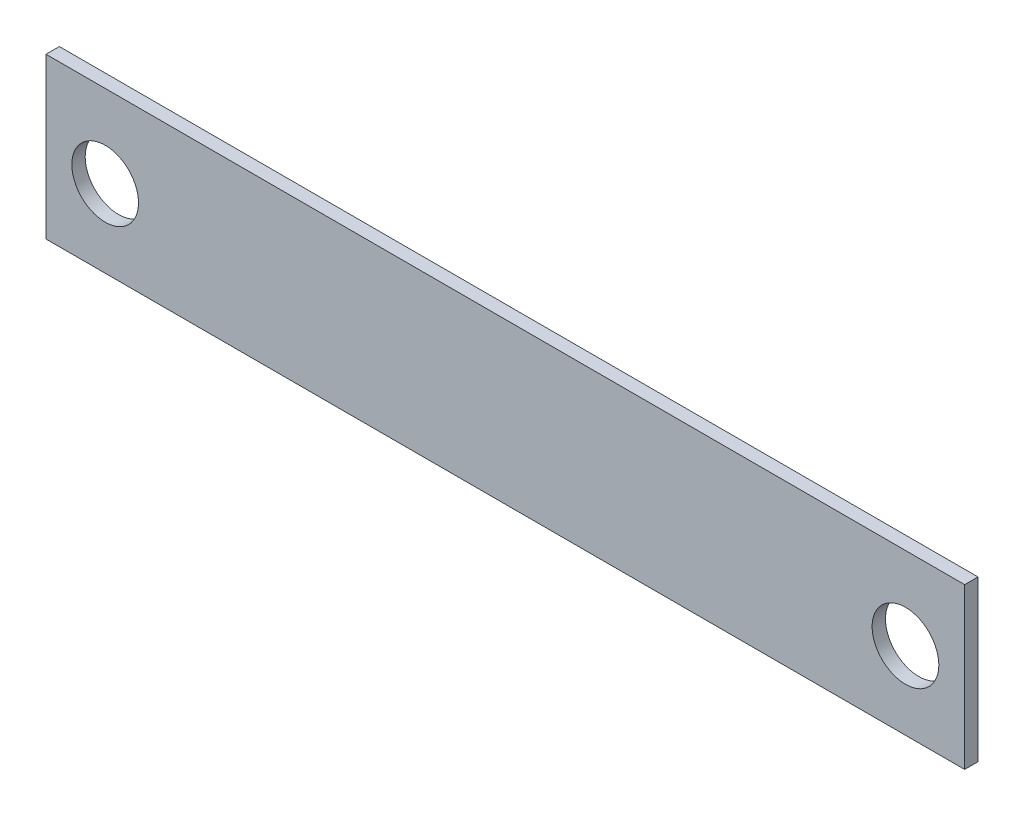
ISO-10303-21;
HEADER;
FILE_DESCRIPTION(('STEP AP214'),'2;1');
FILE_NAME('part.step','',(''),(''),'','','');
FILE_SCHEMA(('AUTOMOTIVE_DESIGN { 1 0 10303 214 1 1 1 1 }'));
ENDSEC;
DATA;
#1=APPLICATION_CONTEXT('core data for automotive mechanical design processes');
#2=APPLICATION_PROTOCOL_DEFINITION('international standard','automotive_design',2000,#1);
#3=PRODUCT_CONTEXT('',#1,'mechanical');
#4=PRODUCT('Part','Part','',(#3));
#5=PRODUCT_RELATED_PRODUCT_CATEGORY('part','',(#4));
#6=PRODUCT_DEFINITION_FORMATION('','',#4);
#7=PRODUCT_DEFINITION_CONTEXT('part definition',#1,'design');
#8=PRODUCT_DEFINITION('design','',#6,#7);
#9=PRODUCT_DEFINITION_SHAPE('','',#8);
#10=(LENGTH_UNIT() NAMED_UNIT(*) SI_UNIT(.MILLI.,.METRE.));
#11=(NAMED_UNIT(*) PLANE_ANGLE_UNIT() SI_UNIT($,.RADIAN.));
#12=(NAMED_UNIT(*) SI_UNIT($,.STERADIAN.) SOLID_ANGLE_UNIT());
#13=UNCERTAINTY_MEASURE_WITH_UNIT(LENGTH_MEASURE(1.E-05),#10,'distance_accuracy_value','');
#14=(GEOMETRIC_REPRESENTATION_CONTEXT(3) GLOBAL_UNCERTAINTY_ASSIGNED_CONTEXT((#13)) GLOBAL_UNIT_ASSIGNED_CONTEXT((#10,
#11,#12)) REPRESENTATION_CONTEXT('',''));
#15=CARTESIAN_POINT('',(0.,0.,0.));
#16=DIRECTION('',(0.,0.,1.));
#17=DIRECTION('',(1.,0.,0.));
#18=AXIS2_PLACEMENT_3D('',#15,#16,#17);
#19=CARTESIAN_POINT('',(0.,0.,50.8));
#20=DIRECTION('',(1.,0.,0.));
#21=DIRECTION('',(0.,0.,-1.));
#22=AXIS2_PLACEMENT_3D('',#19,#20,#21);
#23=PLANE('',#22);
#24=DIRECTION('',(0.,-1.,0.));
#25=VECTOR('',#24,1.);
#26=CARTESIAN_POINT('',(0.,0.,0.));
#27=LINE('',#26,#25);
#28=CARTESIAN_POINT('',(0.,609.6,0.));
#29=VERTEX_POINT('',#28);
#30=CARTESIAN_POINT('',(0.,0.,0.));
#31=VERTEX_POINT('',#30);
#32=EDGE_CURVE('E106',#29,#31,#27,.T.);
#33=ORIENTED_EDGE('',*,*,#32,.T.);
#34=DIRECTION('',(0.,0.,-1.));
#35=VECTOR('',#34,1.);
#36=CARTESIAN_POINT('',(0.,0.,50.8));
#37=LINE('',#36,#35);
#38=CARTESIAN_POINT('',(0.,0.,50.8));
#39=VERTEX_POINT('',#38);
#40=EDGE_CURVE('E11',#39,#31,#37,.T.);
#41=ORIENTED_EDGE('',*,*,#40,.F.);
#42=DIRECTION('',(0.,-1.,0.));
#43=VECTOR('',#42,1.);
#44=CARTESIAN_POINT('',(0.,0.,50.8));
#45=LINE('',#44,#43);
#46=CARTESIAN_POINT('',(0.,609.6,50.8));
#47=VERTEX_POINT('',#46);
#48=EDGE_CURVE('E90',#47,#39,#45,.T.);
#49=ORIENTED_EDGE('',*,*,#48,.F.);
#50=DIRECTION('',(0.,0.,-1.));
#51=VECTOR('',#50,1.);
#52=CARTESIAN_POINT('',(0.,609.6,50.8));
#53=LINE('',#52,#51);
#54=EDGE_CURVE('E102',#47,#29,#53,.T.);
#55=ORIENTED_EDGE('',*,*,#54,.T.);
#56=EDGE_LOOP('',(#33,#41,#49,#55));
#57=FACE_BOUND('',#56,.T.);
#58=ADVANCED_FACE('F38',(#57),#23,.F.);
#59=CARTESIAN_POINT('',(0.,0.,50.8));
#60=DIRECTION('',(0.,1.,0.));
#61=DIRECTION('',(0.,0.,1.));
#62=AXIS2_PLACEMENT_3D('',#59,#60,#61);
#63=PLANE('',#62);
#64=DIRECTION('',(1.,0.,0.));
#65=VECTOR('',#64,1.);
#66=CARTESIAN_POINT('',(0.,0.,0.));
#67=LINE('',#66,#65);
#68=CARTESIAN_POINT('',(3498.85,0.,0.));
#69=VERTEX_POINT('',#68);
#70=EDGE_CURVE('E95',#31,#69,#67,.T.);
#71=ORIENTED_EDGE('',*,*,#70,.T.);
#72=DIRECTION('',(0.,0.,-1.));
#73=VECTOR('',#72,1.);
#74=CARTESIAN_POINT('',(3498.85,0.,50.8));
#75=LINE('',#74,#73);
#76=CARTESIAN_POINT('',(3498.85,0.,50.8));
#77=VERTEX_POINT('',#76);
#78=EDGE_CURVE('E47',#77,#69,#75,.T.);
#79=ORIENTED_EDGE('',*,*,#78,.F.);
#80=DIRECTION('',(1.,0.,0.));
#81=VECTOR('',#80,1.);
#82=CARTESIAN_POINT('',(0.,0.,50.8));
#83=LINE('',#82,#81);
#84=EDGE_CURVE('E85',#39,#77,#83,.T.);
#85=ORIENTED_EDGE('',*,*,#84,.F.);
#86=ORIENTED_EDGE('',*,*,#40,.T.);
#87=EDGE_LOOP('',(#71,#79,#85,#86));
#88=FACE_BOUND('',#87,.T.);
#89=ADVANCED_FACE('F94',(#88),#63,.F.);
#90=CARTESIAN_POINT('',(3498.85,0.,50.8));
#91=DIRECTION('',(-1.,0.,0.));
#92=DIRECTION('',(0.,0.,1.));
#93=AXIS2_PLACEMENT_3D('',#90,#91,#92);
#94=PLANE('',#93);
#95=DIRECTION('',(0.,1.,0.));
#96=VECTOR('',#95,1.);
#97=CARTESIAN_POINT('',(3498.85,0.,0.));
#98=LINE('',#97,#96);
#99=CARTESIAN_POINT('',(3498.85,609.6,0.));
#100=VERTEX_POINT('',#99);
#101=EDGE_CURVE('E72',#69,#100,#98,.T.);
#102=ORIENTED_EDGE('',*,*,#101,.T.);
#103=DIRECTION('',(0.,0.,-1.));
#104=VECTOR('',#103,1.);
#105=CARTESIAN_POINT('',(3498.85,609.6,50.8));
#106=LINE('',#105,#104);
#107=CARTESIAN_POINT('',(3498.85,609.6,50.8));
#108=VERTEX_POINT('',#107);
#109=EDGE_CURVE('E97',#108,#100,#106,.T.);
#110=ORIENTED_EDGE('',*,*,#109,.F.);
#111=DIRECTION('',(0.,1.,0.));
#112=VECTOR('',#111,1.);
#113=CARTESIAN_POINT('',(3498.85,0.,50.8));
#114=LINE('',#113,#112);
#115=EDGE_CURVE('E88',#77,#108,#114,.T.);
#116=ORIENTED_EDGE('',*,*,#115,.F.);
#117=ORIENTED_EDGE('',*,*,#78,.T.);
#118=EDGE_LOOP('',(#102,#110,#116,#117));
#119=FACE_BOUND('',#118,.T.);
#120=ADVANCED_FACE('F98',(#119),#94,.F.);
#121=CARTESIAN_POINT('',(0.,609.6,50.8));
#122=DIRECTION('',(0.,-1.,0.));
#123=DIRECTION('',(0.,0.,-1.));
#124=AXIS2_PLACEMENT_3D('',#121,#122,#123);
#125=PLANE('',#124);
#126=DIRECTION('',(-1.,0.,0.));
#127=VECTOR('',#126,1.);
#128=CARTESIAN_POINT('',(0.,609.6,0.));
#129=LINE('',#128,#127);
#130=EDGE_CURVE('E78',#100,#29,#129,.T.);
#131=ORIENTED_EDGE('',*,*,#130,.T.);
#132=ORIENTED_EDGE('',*,*,#54,.F.);
#133=DIRECTION('',(-1.,0.,0.));
#134=VECTOR('',#133,1.);
#135=CARTESIAN_POINT('',(0.,609.6,50.8));
#136=LINE('',#135,#134);
#137=EDGE_CURVE('E55',#108,#47,#136,.T.);
#138=ORIENTED_EDGE('',*,*,#137,.F.);
#139=ORIENTED_EDGE('',*,*,#109,.T.);
#140=EDGE_LOOP('',(#131,#132,#138,#139));
#141=FACE_BOUND('',#140,.T.);
#142=ADVANCED_FACE('F120',(#141),#125,.F.);
#143=CARTESIAN_POINT('',(0.,0.,50.8));
#144=DIRECTION('',(0.,0.,-1.));
#145=DIRECTION('',(-1.,0.,0.));
#146=AXIS2_PLACEMENT_3D('',#143,#144,#145);
#147=PLANE('',#146);
#148=CARTESIAN_POINT('',(3273.425,295.275,50.8));
#149=DIRECTION('',(0.,0.,1.));
#150=DIRECTION('',(1.,0.,0.));
#151=AXIS2_PLACEMENT_3D('',#148,#149,#150);
#152=CIRCLE('',#151,127.);
#153=CARTESIAN_POINT('',(3400.425,295.275,50.8));
#154=VERTEX_POINT('',#153);
#155=EDGE_CURVE('E135',#154,#154,#152,.T.);
#156=ORIENTED_EDGE('',*,*,#155,.F.);
#157=EDGE_LOOP('',(#156));
#158=FACE_BOUND('',#157,.T.);
#159=CARTESIAN_POINT('',(225.425,295.275,50.8));
#160=DIRECTION('',(0.,0.,-1.));
#161=DIRECTION('',(-1.,0.,0.));
#162=AXIS2_PLACEMENT_3D('',#159,#160,#161);
#163=CIRCLE('',#162,127.);
#164=CARTESIAN_POINT('',(98.425,295.275,50.8));
#165=VERTEX_POINT('',#164);
#166=EDGE_CURVE('E110',#165,#165,#163,.T.);
#167=ORIENTED_EDGE('',*,*,#166,.T.);
#168=EDGE_LOOP('',(#167));
#169=FACE_BOUND('',#168,.T.);
#170=ORIENTED_EDGE('',*,*,#48,.T.);
#171=ORIENTED_EDGE('',*,*,#84,.T.);
#172=ORIENTED_EDGE('',*,*,#115,.T.);
#173=ORIENTED_EDGE('',*,*,#137,.T.);
#174=EDGE_LOOP('',(#170,#171,#172,#173));
#175=FACE_BOUND('',#174,.T.);
#176=ADVANCED_FACE('F86',(#158,#169,#175),#147,.F.);
#177=CARTESIAN_POINT('',(0.,0.,0.));
#178=DIRECTION('',(0.,0.,-1.));
#179=DIRECTION('',(-1.,0.,0.));
#180=AXIS2_PLACEMENT_3D('',#177,#178,#179);
#181=PLANE('',#180);
#182=CARTESIAN_POINT('',(3273.425,295.275,0.));
#183=DIRECTION('',(0.,0.,1.));
#184=DIRECTION('',(1.,0.,0.));
#185=AXIS2_PLACEMENT_3D('',#182,#183,#184);
#186=CIRCLE('',#185,127.);
#187=CARTESIAN_POINT('',(3400.425,295.275,0.));
#188=VERTEX_POINT('',#187);
#189=EDGE_CURVE('E131',#188,#188,#186,.T.);
#190=ORIENTED_EDGE('',*,*,#189,.T.);
#191=EDGE_LOOP('',(#190));
#192=FACE_BOUND('',#191,.T.);
#193=CARTESIAN_POINT('',(225.425,295.275,0.));
#194=DIRECTION('',(0.,0.,-1.));
#195=DIRECTION('',(-1.,0.,0.));
#196=AXIS2_PLACEMENT_3D('',#193,#194,#195);
#197=CIRCLE('',#196,127.);
#198=CARTESIAN_POINT('',(98.425,295.275,0.));
#199=VERTEX_POINT('',#198);
#200=EDGE_CURVE('E127',#199,#199,#197,.T.);
#201=ORIENTED_EDGE('',*,*,#200,.F.);
#202=EDGE_LOOP('',(#201));
#203=FACE_BOUND('',#202,.T.);
#204=ORIENTED_EDGE('',*,*,#32,.F.);
#205=ORIENTED_EDGE('',*,*,#130,.F.);
#206=ORIENTED_EDGE('',*,*,#101,.F.);
#207=ORIENTED_EDGE('',*,*,#70,.F.);
#208=EDGE_LOOP('',(#204,#205,#206,#207));
#209=FACE_BOUND('',#208,.T.);
#210=ADVANCED_FACE('F123',(#192,#203,#209),#181,.T.);
#211=CARTESIAN_POINT('',(225.425,295.275,50.8));
#212=DIRECTION('',(0.,0.,-1.));
#213=DIRECTION('',(-1.,0.,0.));
#214=AXIS2_PLACEMENT_3D('',#211,#212,#213);
#215=CYLINDRICAL_SURFACE('',#214,127.);
#216=ORIENTED_EDGE('',*,*,#166,.F.);
#217=EDGE_LOOP('',(#216));
#218=FACE_BOUND('',#217,.T.);
#219=ORIENTED_EDGE('',*,*,#200,.T.);
#220=EDGE_LOOP('',(#219));
#221=FACE_BOUND('',#220,.T.);
#222=ADVANCED_FACE('F148',(#218,#221),#215,.F.);
#223=CARTESIAN_POINT('',(3273.425,295.275,0.));
#224=DIRECTION('',(0.,0.,1.));
#225=DIRECTION('',(1.,0.,0.));
#226=AXIS2_PLACEMENT_3D('',#223,#224,#225);
#227=CYLINDRICAL_SURFACE('',#226,127.);
#228=ORIENTED_EDGE('',*,*,#189,.F.);
#229=EDGE_LOOP('',(#228));
#230=FACE_BOUND('',#229,.T.);
#231=ORIENTED_EDGE('',*,*,#155,.T.);
#232=EDGE_LOOP('',(#231));
#233=FACE_BOUND('',#232,.T.);
#234=ADVANCED_FACE('F145',(#230,#233),#227,.F.);
#235=CLOSED_SHELL('',(#58,#89,#120,#142,#176,#210,#222,#234));
#236=MANIFOLD_SOLID_BREP('B2',#235);
#237=ADVANCED_BREP_SHAPE_REPRESENTATION('',(#18,#236),#14);
#238=SHAPE_DEFINITION_REPRESENTATION(#9,#237);
ENDSEC;
END-ISO-10303-21;
